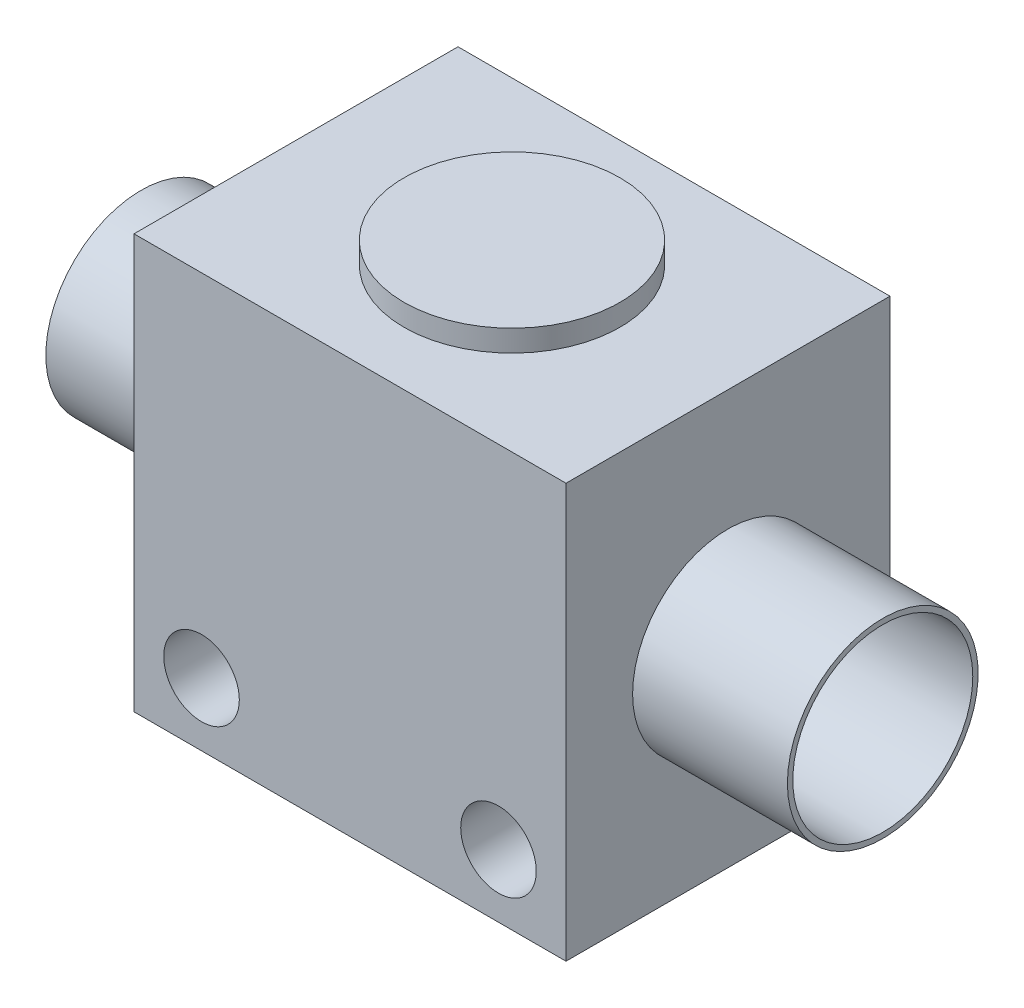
ISO-10303-21;
HEADER;
FILE_DESCRIPTION(('STEP AP214'),'2;1');
FILE_NAME('part.step','',(''),(''),'','','');
FILE_SCHEMA(('AUTOMOTIVE_DESIGN { 1 0 10303 214 1 1 1 1 }'));
ENDSEC;
DATA;
#1=APPLICATION_CONTEXT('core data for automotive mechanical design processes');
#2=APPLICATION_PROTOCOL_DEFINITION('international standard','automotive_design',2000,#1);
#3=PRODUCT_CONTEXT('',#1,'mechanical');
#4=PRODUCT('Part','Part','',(#3));
#5=PRODUCT_RELATED_PRODUCT_CATEGORY('part','',(#4));
#6=PRODUCT_DEFINITION_FORMATION('','',#4);
#7=PRODUCT_DEFINITION_CONTEXT('part definition',#1,'design');
#8=PRODUCT_DEFINITION('design','',#6,#7);
#9=PRODUCT_DEFINITION_SHAPE('','',#8);
#10=(LENGTH_UNIT() NAMED_UNIT(*) SI_UNIT(.MILLI.,.METRE.));
#11=(NAMED_UNIT(*) PLANE_ANGLE_UNIT() SI_UNIT($,.RADIAN.));
#12=(NAMED_UNIT(*) SI_UNIT($,.STERADIAN.) SOLID_ANGLE_UNIT());
#13=UNCERTAINTY_MEASURE_WITH_UNIT(LENGTH_MEASURE(1.E-05),#10,'distance_accuracy_value','');
#14=(GEOMETRIC_REPRESENTATION_CONTEXT(3) GLOBAL_UNCERTAINTY_ASSIGNED_CONTEXT((#13)) GLOBAL_UNIT_ASSIGNED_CONTEXT((#10,
#11,#12)) REPRESENTATION_CONTEXT('',''));
#15=CARTESIAN_POINT('',(0.,0.,0.));
#16=DIRECTION('',(0.,0.,1.));
#17=DIRECTION('',(1.,0.,0.));
#18=AXIS2_PLACEMENT_3D('',#15,#16,#17);
#19=CARTESIAN_POINT('',(-12.,12.,9.));
#20=DIRECTION('',(0.,-1.,0.));
#21=DIRECTION('',(0.,0.,-1.));
#22=AXIS2_PLACEMENT_3D('',#19,#20,#21);
#23=PLANE('',#22);
#24=DIRECTION('',(-1.,0.,0.));
#25=VECTOR('',#24,1.);
#26=CARTESIAN_POINT('',(-12.,12.,-9.));
#27=LINE('',#26,#25);
#28=CARTESIAN_POINT('',(12.,12.,-9.));
#29=VERTEX_POINT('',#28);
#30=CARTESIAN_POINT('',(-12.,12.,-9.));
#31=VERTEX_POINT('',#30);
#32=EDGE_CURVE('E101',#29,#31,#27,.T.);
#33=ORIENTED_EDGE('',*,*,#32,.T.);
#34=DIRECTION('',(0.,0.,-1.));
#35=VECTOR('',#34,1.);
#36=CARTESIAN_POINT('',(-12.,12.,9.));
#37=LINE('',#36,#35);
#38=CARTESIAN_POINT('',(-12.,12.,9.));
#39=VERTEX_POINT('',#38);
#40=EDGE_CURVE('E92',#39,#31,#37,.T.);
#41=ORIENTED_EDGE('',*,*,#40,.F.);
#42=DIRECTION('',(-1.,0.,0.));
#43=VECTOR('',#42,1.);
#44=CARTESIAN_POINT('',(-12.,12.,9.));
#45=LINE('',#44,#43);
#46=CARTESIAN_POINT('',(12.,12.,9.));
#47=VERTEX_POINT('',#46);
#48=EDGE_CURVE('E44',#47,#39,#45,.T.);
#49=ORIENTED_EDGE('',*,*,#48,.F.);
#50=DIRECTION('',(0.,0.,-1.));
#51=VECTOR('',#50,1.);
#52=CARTESIAN_POINT('',(12.,12.,9.));
#53=LINE('',#52,#51);
#54=EDGE_CURVE('E109',#47,#29,#53,.T.);
#55=ORIENTED_EDGE('',*,*,#54,.T.);
#56=EDGE_LOOP('',(#33,#41,#49,#55));
#57=FACE_BOUND('',#56,.T.);
#58=CARTESIAN_POINT('',(0.,12.,0.));
#59=DIRECTION('',(0.,-1.,0.));
#60=DIRECTION('',(0.,0.,-1.));
#61=AXIS2_PLACEMENT_3D('',#58,#59,#60);
#62=CIRCLE('',#61,6.);
#63=CARTESIAN_POINT('',(0.,12.,-6.));
#64=VERTEX_POINT('',#63);
#65=EDGE_CURVE('E11',#64,#64,#62,.F.);
#66=ORIENTED_EDGE('',*,*,#65,.F.);
#67=EDGE_LOOP('',(#66));
#68=FACE_BOUND('',#67,.T.);
#69=ADVANCED_FACE('F29',(#57,#68),#23,.F.);
#70=CARTESIAN_POINT('',(-12.,-11.,9.));
#71=DIRECTION('',(1.,0.,0.));
#72=DIRECTION('',(0.,0.,-1.));
#73=AXIS2_PLACEMENT_3D('',#70,#71,#72);
#74=PLANE('',#73);
#75=DIRECTION('',(0.,-1.,0.));
#76=VECTOR('',#75,1.);
#77=CARTESIAN_POINT('',(-12.,-11.,-8.99999999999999));
#78=LINE('',#77,#76);
#79=CARTESIAN_POINT('',(-12.,-11.,-8.99999999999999));
#80=VERTEX_POINT('',#79);
#81=EDGE_CURVE('E75',#31,#80,#78,.T.);
#82=ORIENTED_EDGE('',*,*,#81,.T.);
#83=DIRECTION('',(0.,0.,-1.));
#84=VECTOR('',#83,1.);
#85=CARTESIAN_POINT('',(-12.,-11.,9.));
#86=LINE('',#85,#84);
#87=CARTESIAN_POINT('',(-12.,-11.,9.));
#88=VERTEX_POINT('',#87);
#89=EDGE_CURVE('E82',#88,#80,#86,.T.);
#90=ORIENTED_EDGE('',*,*,#89,.F.);
#91=DIRECTION('',(0.,-1.,0.));
#92=VECTOR('',#91,1.);
#93=CARTESIAN_POINT('',(-12.,-11.,9.));
#94=LINE('',#93,#92);
#95=EDGE_CURVE('E103',#39,#88,#94,.T.);
#96=ORIENTED_EDGE('',*,*,#95,.F.);
#97=ORIENTED_EDGE('',*,*,#40,.T.);
#98=EDGE_LOOP('',(#82,#90,#96,#97));
#99=FACE_BOUND('',#98,.T.);
#100=CARTESIAN_POINT('',(-12.,0.,0.));
#101=DIRECTION('',(1.,0.,0.));
#102=DIRECTION('',(0.,0.,-1.));
#103=AXIS2_PLACEMENT_3D('',#100,#101,#102);
#104=CIRCLE('',#103,5.3);
#105=CARTESIAN_POINT('',(-12.,0.,-5.3));
#106=VERTEX_POINT('',#105);
#107=EDGE_CURVE('E37',#106,#106,#104,.F.);
#108=ORIENTED_EDGE('',*,*,#107,.F.);
#109=EDGE_LOOP('',(#108));
#110=FACE_BOUND('',#109,.T.);
#111=ADVANCED_FACE('F31',(#99,#110),#74,.F.);
#112=CARTESIAN_POINT('',(12.,-11.,9.));
#113=DIRECTION('',(-1.,0.,0.));
#114=DIRECTION('',(0.,0.,1.));
#115=AXIS2_PLACEMENT_3D('',#112,#113,#114);
#116=PLANE('',#115);
#117=DIRECTION('',(0.,1.,0.));
#118=VECTOR('',#117,1.);
#119=CARTESIAN_POINT('',(12.,-11.,-8.99999999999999));
#120=LINE('',#119,#118);
#121=CARTESIAN_POINT('',(12.,-11.,-8.99999999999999));
#122=VERTEX_POINT('',#121);
#123=EDGE_CURVE('E76',#122,#29,#120,.T.);
#124=ORIENTED_EDGE('',*,*,#123,.T.);
#125=ORIENTED_EDGE('',*,*,#54,.F.);
#126=DIRECTION('',(0.,1.,0.));
#127=VECTOR('',#126,1.);
#128=CARTESIAN_POINT('',(12.,-11.,9.));
#129=LINE('',#128,#127);
#130=CARTESIAN_POINT('',(12.,-11.,9.));
#131=VERTEX_POINT('',#130);
#132=EDGE_CURVE('E49',#131,#47,#129,.T.);
#133=ORIENTED_EDGE('',*,*,#132,.F.);
#134=DIRECTION('',(0.,0.,-1.));
#135=VECTOR('',#134,1.);
#136=CARTESIAN_POINT('',(12.,-11.,9.));
#137=LINE('',#136,#135);
#138=EDGE_CURVE('E88',#131,#122,#137,.T.);
#139=ORIENTED_EDGE('',*,*,#138,.T.);
#140=EDGE_LOOP('',(#124,#125,#133,#139));
#141=FACE_BOUND('',#140,.T.);
#142=CARTESIAN_POINT('',(12.,0.,0.));
#143=DIRECTION('',(-1.,0.,0.));
#144=DIRECTION('',(0.,0.,1.));
#145=AXIS2_PLACEMENT_3D('',#142,#143,#144);
#146=CIRCLE('',#145,5.3);
#147=CARTESIAN_POINT('',(12.,0.,5.3));
#148=VERTEX_POINT('',#147);
#149=EDGE_CURVE('E87',#148,#148,#146,.F.);
#150=ORIENTED_EDGE('',*,*,#149,.F.);
#151=EDGE_LOOP('',(#150));
#152=FACE_BOUND('',#151,.T.);
#153=ADVANCED_FACE('F119',(#141,#152),#116,.F.);
#154=CARTESIAN_POINT('',(-12.,-11.,9.));
#155=DIRECTION('',(0.,1.,0.));
#156=DIRECTION('',(0.,0.,1.));
#157=AXIS2_PLACEMENT_3D('',#154,#155,#156);
#158=PLANE('',#157);
#159=DIRECTION('',(1.,0.,0.));
#160=VECTOR('',#159,1.);
#161=CARTESIAN_POINT('',(-12.,-11.,-8.99999999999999));
#162=LINE('',#161,#160);
#163=EDGE_CURVE('E70',#80,#122,#162,.T.);
#164=ORIENTED_EDGE('',*,*,#163,.T.);
#165=ORIENTED_EDGE('',*,*,#138,.F.);
#166=DIRECTION('',(1.,0.,0.));
#167=VECTOR('',#166,1.);
#168=CARTESIAN_POINT('',(-12.,-11.,9.));
#169=LINE('',#168,#167);
#170=EDGE_CURVE('E84',#88,#131,#169,.T.);
#171=ORIENTED_EDGE('',*,*,#170,.F.);
#172=ORIENTED_EDGE('',*,*,#89,.T.);
#173=EDGE_LOOP('',(#164,#165,#171,#172));
#174=FACE_BOUND('',#173,.T.);
#175=ADVANCED_FACE('F83',(#174),#158,.F.);
#176=CARTESIAN_POINT('',(-12.,12.,9.));
#177=DIRECTION('',(0.,0.,-1.));
#178=DIRECTION('',(-1.,0.,0.));
#179=AXIS2_PLACEMENT_3D('',#176,#177,#178);
#180=PLANE('',#179);
#181=CARTESIAN_POINT('',(8.25000000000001,-7.5,9.));
#182=DIRECTION('',(0.,0.,1.));
#183=DIRECTION('',(-1.,0.,0.));
#184=AXIS2_PLACEMENT_3D('',#181,#182,#183);
#185=CIRCLE('',#184,2.1);
#186=CARTESIAN_POINT('',(6.15000000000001,-7.5,9.));
#187=VERTEX_POINT('',#186);
#188=EDGE_CURVE('E147',#187,#187,#185,.T.);
#189=ORIENTED_EDGE('',*,*,#188,.F.);
#190=EDGE_LOOP('',(#189));
#191=FACE_BOUND('',#190,.T.);
#192=CARTESIAN_POINT('',(-8.25000000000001,-7.5,9.));
#193=DIRECTION('',(0.,0.,1.));
#194=DIRECTION('',(1.,0.,0.));
#195=AXIS2_PLACEMENT_3D('',#192,#193,#194);
#196=CIRCLE('',#195,2.1);
#197=CARTESIAN_POINT('',(-6.15000000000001,-7.5,9.));
#198=VERTEX_POINT('',#197);
#199=EDGE_CURVE('E150',#198,#198,#196,.T.);
#200=ORIENTED_EDGE('',*,*,#199,.F.);
#201=EDGE_LOOP('',(#200));
#202=FACE_BOUND('',#201,.T.);
#203=ORIENTED_EDGE('',*,*,#95,.T.);
#204=ORIENTED_EDGE('',*,*,#170,.T.);
#205=ORIENTED_EDGE('',*,*,#132,.T.);
#206=ORIENTED_EDGE('',*,*,#48,.T.);
#207=EDGE_LOOP('',(#203,#204,#205,#206));
#208=FACE_BOUND('',#207,.T.);
#209=ADVANCED_FACE('F132',(#191,#202,#208),#180,.F.);
#210=CARTESIAN_POINT('',(-12.,12.,-9.));
#211=DIRECTION('',(0.,0.,-1.));
#212=DIRECTION('',(-1.,0.,0.));
#213=AXIS2_PLACEMENT_3D('',#210,#211,#212);
#214=PLANE('',#213);
#215=CARTESIAN_POINT('',(8.25000000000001,-7.49999999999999,-9.));
#216=DIRECTION('',(0.,0.,1.));
#217=DIRECTION('',(-1.,0.,0.));
#218=AXIS2_PLACEMENT_3D('',#215,#216,#217);
#219=CIRCLE('',#218,2.1);
#220=CARTESIAN_POINT('',(6.15000000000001,-7.49999999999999,-9.));
#221=VERTEX_POINT('',#220);
#222=EDGE_CURVE('E208',#221,#221,#219,.T.);
#223=ORIENTED_EDGE('',*,*,#222,.T.);
#224=EDGE_LOOP('',(#223));
#225=FACE_BOUND('',#224,.T.);
#226=CARTESIAN_POINT('',(-8.25000000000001,-7.5,-9.));
#227=DIRECTION('',(0.,0.,1.));
#228=DIRECTION('',(1.,0.,0.));
#229=AXIS2_PLACEMENT_3D('',#226,#227,#228);
#230=CIRCLE('',#229,2.1);
#231=CARTESIAN_POINT('',(-6.15000000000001,-7.5,-9.));
#232=VERTEX_POINT('',#231);
#233=EDGE_CURVE('E213',#232,#232,#230,.T.);
#234=ORIENTED_EDGE('',*,*,#233,.T.);
#235=EDGE_LOOP('',(#234));
#236=FACE_BOUND('',#235,.T.);
#237=ORIENTED_EDGE('',*,*,#81,.F.);
#238=ORIENTED_EDGE('',*,*,#32,.F.);
#239=ORIENTED_EDGE('',*,*,#123,.F.);
#240=ORIENTED_EDGE('',*,*,#163,.F.);
#241=EDGE_LOOP('',(#237,#238,#239,#240));
#242=FACE_BOUND('',#241,.T.);
#243=ADVANCED_FACE('F72',(#225,#236,#242),#214,.T.);
#244=CARTESIAN_POINT('',(20.6,0.,0.));
#245=DIRECTION('',(-1.,0.,0.));
#246=DIRECTION('',(0.,0.,1.));
#247=AXIS2_PLACEMENT_3D('',#244,#245,#246);
#248=CYLINDRICAL_SURFACE('',#247,5.3);
#249=CARTESIAN_POINT('',(20.6,0.,0.));
#250=DIRECTION('',(1.,0.,0.));
#251=DIRECTION('',(0.,0.,-1.));
#252=AXIS2_PLACEMENT_3D('',#249,#250,#251);
#253=CIRCLE('',#252,5.3);
#254=CARTESIAN_POINT('',(20.6,0.,5.3));
#255=VERTEX_POINT('',#254);
#256=EDGE_CURVE('E93',#255,#255,#253,.T.);
#257=CARTESIAN_POINT('',(20.6,0.,5.3));
#258=CARTESIAN_POINT('',(20.5104166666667,0.,5.3));
#259=CARTESIAN_POINT('',(20.4208333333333,0.,5.3));
#260=CARTESIAN_POINT('',(20.2416666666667,0.,5.3));
#261=CARTESIAN_POINT('',(20.1520833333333,0.,5.3));
#262=CARTESIAN_POINT('',(19.9729166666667,0.,5.3));
#263=CARTESIAN_POINT('',(19.8833333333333,0.,5.3));
#264=CARTESIAN_POINT('',(19.7041666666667,0.,5.3));
#265=CARTESIAN_POINT('',(19.6145833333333,0.,5.3));
#266=CARTESIAN_POINT('',(19.4354166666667,0.,5.3));
#267=CARTESIAN_POINT('',(19.3458333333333,0.,5.3));
#268=CARTESIAN_POINT('',(19.1666666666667,0.,5.3));
#269=CARTESIAN_POINT('',(19.0770833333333,0.,5.3));
#270=CARTESIAN_POINT('',(18.8979166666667,0.,5.3));
#271=CARTESIAN_POINT('',(18.8083333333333,0.,5.3));
#272=CARTESIAN_POINT('',(18.6291666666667,0.,5.3));
#273=CARTESIAN_POINT('',(18.5395833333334,0.,5.3));
#274=CARTESIAN_POINT('',(18.3604166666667,0.,5.3));
#275=CARTESIAN_POINT('',(18.2708333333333,0.,5.3));
#276=CARTESIAN_POINT('',(18.0916666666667,0.,5.3));
#277=CARTESIAN_POINT('',(18.0020833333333,0.,5.3));
#278=CARTESIAN_POINT('',(17.8229166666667,0.,5.3));
#279=CARTESIAN_POINT('',(17.7333333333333,0.,5.3));
#280=CARTESIAN_POINT('',(17.5541666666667,0.,5.3));
#281=CARTESIAN_POINT('',(17.4645833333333,0.,5.3));
#282=CARTESIAN_POINT('',(17.2854166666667,0.,5.3));
#283=CARTESIAN_POINT('',(17.1958333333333,0.,5.3));
#284=CARTESIAN_POINT('',(17.0166666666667,0.,5.3));
#285=CARTESIAN_POINT('',(16.9270833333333,0.,5.3));
#286=CARTESIAN_POINT('',(16.7479166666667,0.,5.3));
#287=CARTESIAN_POINT('',(16.6583333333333,0.,5.3));
#288=CARTESIAN_POINT('',(16.4791666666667,0.,5.3));
#289=CARTESIAN_POINT('',(16.3895833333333,0.,5.3));
#290=CARTESIAN_POINT('',(16.2104166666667,0.,5.3));
#291=CARTESIAN_POINT('',(16.1208333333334,0.,5.3));
#292=CARTESIAN_POINT('',(15.9416666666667,0.,5.3));
#293=CARTESIAN_POINT('',(15.8520833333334,0.,5.3));
#294=CARTESIAN_POINT('',(15.6729166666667,0.,5.3));
#295=CARTESIAN_POINT('',(15.5833333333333,0.,5.3));
#296=CARTESIAN_POINT('',(15.4041666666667,0.,5.3));
#297=CARTESIAN_POINT('',(15.3145833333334,0.,5.3));
#298=CARTESIAN_POINT('',(15.1354166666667,0.,5.3));
#299=CARTESIAN_POINT('',(15.0458333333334,0.,5.3));
#300=CARTESIAN_POINT('',(14.8666666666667,0.,5.3));
#301=CARTESIAN_POINT('',(14.7770833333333,0.,5.3));
#302=CARTESIAN_POINT('',(14.5979166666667,0.,5.3));
#303=CARTESIAN_POINT('',(14.5083333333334,0.,5.3));
#304=CARTESIAN_POINT('',(14.3291666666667,0.,5.3));
#305=CARTESIAN_POINT('',(14.2395833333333,0.,5.3));
#306=CARTESIAN_POINT('',(14.0604166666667,0.,5.3));
#307=CARTESIAN_POINT('',(13.9708333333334,0.,5.3));
#308=CARTESIAN_POINT('',(13.7916666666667,0.,5.3));
#309=CARTESIAN_POINT('',(13.7020833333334,0.,5.3));
#310=CARTESIAN_POINT('',(13.5229166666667,0.,5.3));
#311=CARTESIAN_POINT('',(13.4333333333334,0.,5.3));
#312=CARTESIAN_POINT('',(13.2541666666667,0.,5.3));
#313=CARTESIAN_POINT('',(13.1645833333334,0.,5.3));
#314=CARTESIAN_POINT('',(12.9854166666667,0.,5.3));
#315=CARTESIAN_POINT('',(12.8958333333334,0.,5.3));
#316=CARTESIAN_POINT('',(12.7166666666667,0.,5.3));
#317=CARTESIAN_POINT('',(12.6270833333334,0.,5.3));
#318=CARTESIAN_POINT('',(12.4479166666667,0.,5.3));
#319=CARTESIAN_POINT('',(12.3583333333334,0.,5.3));
#320=CARTESIAN_POINT('',(12.1791666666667,0.,5.3));
#321=CARTESIAN_POINT('',(12.0895833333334,0.,5.3));
#322=CARTESIAN_POINT('',(12.,0.,5.3));
#323=B_SPLINE_CURVE_WITH_KNOTS('',3,(#257,#258,#259,#260,#261,#262,#263,#264,#265,#266,#267,
#268,#269,#270,#271,#272,#273,#274,#275,#276,#277,#278,#279,#280,#281,#282,#283,#284,#285,#286,
#287,#288,#289,#290,#291,#292,#293,#294,#295,#296,#297,#298,#299,#300,#301,#302,#303,#304,#305,
#306,#307,#308,#309,#310,#311,#312,#313,#314,#315,#316,#317,#318,#319,#320,#321,#322),
.UNSPECIFIED.,.F.,.F.,(4,2,2,2,2,2,2,2,2,2,2,2,2,2,2,2,2,2,2,2,2,2,2,2,2,2,2,2,2,2,2,2,4),(0.,
0.268750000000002,0.5375,0.806250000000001,1.075,1.34375,1.6125,1.88125,2.15,2.41875,2.6875,
2.95625,3.225,3.49375,3.7625,4.03125,4.3,4.56875,4.8375,5.10625,5.375,5.64375,5.9125,6.18125,
6.45,6.71875,6.9875,7.25625,7.525,7.79374999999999,8.06249999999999,8.33125,8.59999999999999),.UNSPECIFIED.);
#324=EDGE_CURVE('BSEAM142',#255,#148,#323,.T.);
#325=ORIENTED_EDGE('',*,*,#256,.F.);
#326=ORIENTED_EDGE('',*,*,#149,.T.);
#327=ORIENTED_EDGE('',*,*,#324,.T.);
#328=ORIENTED_EDGE('',*,*,#324,.F.);
#329=EDGE_LOOP('',(#325,#327,#326,#328));
#330=FACE_BOUND('',#329,.T.);
#331=ADVANCED_FACE('F142',(#330),#248,.T.);
#332=CARTESIAN_POINT('',(20.6,0.,0.));
#333=DIRECTION('',(1.,0.,0.));
#334=DIRECTION('',(0.,0.,-1.));
#335=AXIS2_PLACEMENT_3D('',#332,#333,#334);
#336=PLANE('',#335);
#337=CARTESIAN_POINT('',(20.6,0.,0.));
#338=DIRECTION('',(1.,0.,0.));
#339=DIRECTION('',(0.,0.,-1.));
#340=AXIS2_PLACEMENT_3D('',#337,#338,#339);
#341=CIRCLE('',#340,5.);
#342=CARTESIAN_POINT('',(20.6,0.,-5.));
#343=VERTEX_POINT('',#342);
#344=EDGE_CURVE('E228',#343,#343,#341,.T.);
#345=ORIENTED_EDGE('',*,*,#344,.F.);
#346=EDGE_LOOP('',(#345));
#347=FACE_BOUND('',#346,.T.);
#348=ORIENTED_EDGE('',*,*,#256,.T.);
#349=EDGE_LOOP('',(#348));
#350=FACE_BOUND('',#349,.T.);
#351=ADVANCED_FACE('F155',(#347,#350),#336,.T.);
#352=CARTESIAN_POINT('',(10.6,0.,0.));
#353=DIRECTION('',(1.,0.,0.));
#354=DIRECTION('',(0.,0.,-1.));
#355=AXIS2_PLACEMENT_3D('',#352,#353,#354);
#356=CYLINDRICAL_SURFACE('',#355,5.);
#357=CARTESIAN_POINT('',(10.6,0.,0.));
#358=DIRECTION('',(1.,0.,0.));
#359=DIRECTION('',(0.,0.,-1.));
#360=AXIS2_PLACEMENT_3D('',#357,#358,#359);
#361=CIRCLE('',#360,5.);
#362=CARTESIAN_POINT('',(10.6,0.,-5.));
#363=VERTEX_POINT('',#362);
#364=EDGE_CURVE('E96',#363,#363,#361,.T.);
#365=ORIENTED_EDGE('',*,*,#364,.F.);
#366=EDGE_LOOP('',(#365));
#367=FACE_BOUND('',#366,.T.);
#368=ORIENTED_EDGE('',*,*,#344,.T.);
#369=EDGE_LOOP('',(#368));
#370=FACE_BOUND('',#369,.T.);
#371=ADVANCED_FACE('F161',(#367,#370),#356,.F.);
#372=CARTESIAN_POINT('',(10.6,0.,0.));
#373=DIRECTION('',(1.,0.,0.));
#374=DIRECTION('',(0.,0.,-1.));
#375=AXIS2_PLACEMENT_3D('',#372,#373,#374);
#376=PLANE('',#375);
#377=ORIENTED_EDGE('',*,*,#364,.T.);
#378=EDGE_LOOP('',(#377));
#379=FACE_BOUND('',#378,.T.);
#380=ADVANCED_FACE('F168',(#379),#376,.T.);
#381=CARTESIAN_POINT('',(-20.6,0.,0.));
#382=DIRECTION('',(1.,0.,0.));
#383=DIRECTION('',(0.,0.,-1.));
#384=AXIS2_PLACEMENT_3D('',#381,#382,#383);
#385=CYLINDRICAL_SURFACE('',#384,5.3);
#386=CARTESIAN_POINT('',(-20.6,0.,0.));
#387=DIRECTION('',(-1.,0.,0.));
#388=DIRECTION('',(0.,0.,1.));
#389=AXIS2_PLACEMENT_3D('',#386,#387,#388);
#390=CIRCLE('',#389,5.3);
#391=CARTESIAN_POINT('',(-20.6,0.,-5.3));
#392=VERTEX_POINT('',#391);
#393=EDGE_CURVE('E225',#392,#392,#390,.T.);
#394=CARTESIAN_POINT('',(-20.6,0.,-5.3));
#395=CARTESIAN_POINT('',(-20.5104166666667,0.,-5.3));
#396=CARTESIAN_POINT('',(-20.4208333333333,0.,-5.3));
#397=CARTESIAN_POINT('',(-20.2416666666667,0.,-5.3));
#398=CARTESIAN_POINT('',(-20.1520833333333,0.,-5.3));
#399=CARTESIAN_POINT('',(-19.9729166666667,0.,-5.3));
#400=CARTESIAN_POINT('',(-19.8833333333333,0.,-5.3));
#401=CARTESIAN_POINT('',(-19.7041666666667,0.,-5.3));
#402=CARTESIAN_POINT('',(-19.6145833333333,0.,-5.3));
#403=CARTESIAN_POINT('',(-19.4354166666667,0.,-5.3));
#404=CARTESIAN_POINT('',(-19.3458333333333,0.,-5.3));
#405=CARTESIAN_POINT('',(-19.1666666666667,0.,-5.3));
#406=CARTESIAN_POINT('',(-19.0770833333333,0.,-5.3));
#407=CARTESIAN_POINT('',(-18.8979166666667,0.,-5.3));
#408=CARTESIAN_POINT('',(-18.8083333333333,0.,-5.3));
#409=CARTESIAN_POINT('',(-18.6291666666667,0.,-5.3));
#410=CARTESIAN_POINT('',(-18.5395833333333,0.,-5.3));
#411=CARTESIAN_POINT('',(-18.3604166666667,0.,-5.3));
#412=CARTESIAN_POINT('',(-18.2708333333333,0.,-5.3));
#413=CARTESIAN_POINT('',(-18.0916666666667,0.,-5.3));
#414=CARTESIAN_POINT('',(-18.0020833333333,0.,-5.3));
#415=CARTESIAN_POINT('',(-17.8229166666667,0.,-5.3));
#416=CARTESIAN_POINT('',(-17.7333333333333,0.,-5.3));
#417=CARTESIAN_POINT('',(-17.5541666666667,0.,-5.3));
#418=CARTESIAN_POINT('',(-17.4645833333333,0.,-5.3));
#419=CARTESIAN_POINT('',(-17.2854166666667,0.,-5.3));
#420=CARTESIAN_POINT('',(-17.1958333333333,0.,-5.3));
#421=CARTESIAN_POINT('',(-17.0166666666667,0.,-5.3));
#422=CARTESIAN_POINT('',(-16.9270833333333,0.,-5.3));
#423=CARTESIAN_POINT('',(-16.7479166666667,0.,-5.3));
#424=CARTESIAN_POINT('',(-16.6583333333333,0.,-5.3));
#425=CARTESIAN_POINT('',(-16.4791666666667,0.,-5.3));
#426=CARTESIAN_POINT('',(-16.3895833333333,0.,-5.3));
#427=CARTESIAN_POINT('',(-16.2104166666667,0.,-5.3));
#428=CARTESIAN_POINT('',(-16.1208333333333,0.,-5.3));
#429=CARTESIAN_POINT('',(-15.9416666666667,0.,-5.3));
#430=CARTESIAN_POINT('',(-15.8520833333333,0.,-5.3));
#431=CARTESIAN_POINT('',(-15.6729166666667,0.,-5.3));
#432=CARTESIAN_POINT('',(-15.5833333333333,0.,-5.3));
#433=CARTESIAN_POINT('',(-15.4041666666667,0.,-5.3));
#434=CARTESIAN_POINT('',(-15.3145833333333,0.,-5.3));
#435=CARTESIAN_POINT('',(-15.1354166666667,0.,-5.3));
#436=CARTESIAN_POINT('',(-15.0458333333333,0.,-5.3));
#437=CARTESIAN_POINT('',(-14.8666666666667,0.,-5.3));
#438=CARTESIAN_POINT('',(-14.7770833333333,0.,-5.3));
#439=CARTESIAN_POINT('',(-14.5979166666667,0.,-5.3));
#440=CARTESIAN_POINT('',(-14.5083333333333,0.,-5.3));
#441=CARTESIAN_POINT('',(-14.3291666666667,0.,-5.3));
#442=CARTESIAN_POINT('',(-14.2395833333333,0.,-5.3));
#443=CARTESIAN_POINT('',(-14.0604166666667,0.,-5.3));
#444=CARTESIAN_POINT('',(-13.9708333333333,0.,-5.3));
#445=CARTESIAN_POINT('',(-13.7916666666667,0.,-5.3));
#446=CARTESIAN_POINT('',(-13.7020833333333,0.,-5.3));
#447=CARTESIAN_POINT('',(-13.5229166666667,0.,-5.3));
#448=CARTESIAN_POINT('',(-13.4333333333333,0.,-5.3));
#449=CARTESIAN_POINT('',(-13.2541666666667,0.,-5.3));
#450=CARTESIAN_POINT('',(-13.1645833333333,0.,-5.3));
#451=CARTESIAN_POINT('',(-12.9854166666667,0.,-5.3));
#452=CARTESIAN_POINT('',(-12.8958333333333,0.,-5.3));
#453=CARTESIAN_POINT('',(-12.7166666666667,0.,-5.3));
#454=CARTESIAN_POINT('',(-12.6270833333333,0.,-5.3));
#455=CARTESIAN_POINT('',(-12.4479166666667,0.,-5.3));
#456=CARTESIAN_POINT('',(-12.3583333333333,0.,-5.3));
#457=CARTESIAN_POINT('',(-12.1791666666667,0.,-5.3));
#458=CARTESIAN_POINT('',(-12.0895833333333,0.,-5.3));
#459=CARTESIAN_POINT('',(-12.,0.,-5.3));
#460=B_SPLINE_CURVE_WITH_KNOTS('',3,(#394,#395,#396,#397,#398,#399,#400,#401,#402,#403,#404,
#405,#406,#407,#408,#409,#410,#411,#412,#413,#414,#415,#416,#417,#418,#419,#420,#421,#422,#423,
#424,#425,#426,#427,#428,#429,#430,#431,#432,#433,#434,#435,#436,#437,#438,#439,#440,#441,#442,
#443,#444,#445,#446,#447,#448,#449,#450,#451,#452,#453,#454,#455,#456,#457,#458,#459),
.UNSPECIFIED.,.F.,.F.,(4,2,2,2,2,2,2,2,2,2,2,2,2,2,2,2,2,2,2,2,2,2,2,2,2,2,2,2,2,2,2,2,4),(0.,
0.268750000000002,0.5375,0.806250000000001,1.075,1.34375,1.6125,1.88125,2.15,2.41875,2.6875,
2.95625,3.225,3.49375,3.7625,4.03125,4.3,4.56875,4.8375,5.10625,5.375,5.64375,5.9125,6.18125,
6.45,6.71875,6.9875,7.25625,7.525,7.79374999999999,8.06249999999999,8.33125,8.59999999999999),.UNSPECIFIED.);
#461=EDGE_CURVE('BSEAM117',#392,#106,#460,.T.);
#462=ORIENTED_EDGE('',*,*,#393,.F.);
#463=ORIENTED_EDGE('',*,*,#107,.T.);
#464=ORIENTED_EDGE('',*,*,#461,.T.);
#465=ORIENTED_EDGE('',*,*,#461,.F.);
#466=EDGE_LOOP('',(#462,#464,#463,#465));
#467=FACE_BOUND('',#466,.T.);
#468=ADVANCED_FACE('F117',(#467),#385,.T.);
#469=CARTESIAN_POINT('',(-20.6,0.,0.));
#470=DIRECTION('',(-1.,0.,0.));
#471=DIRECTION('',(0.,0.,1.));
#472=AXIS2_PLACEMENT_3D('',#469,#470,#471);
#473=PLANE('',#472);
#474=CARTESIAN_POINT('',(-20.6,0.,0.));
#475=DIRECTION('',(-1.,0.,0.));
#476=DIRECTION('',(0.,0.,1.));
#477=AXIS2_PLACEMENT_3D('',#474,#475,#476);
#478=CIRCLE('',#477,5.);
#479=CARTESIAN_POINT('',(-20.6,0.,5.));
#480=VERTEX_POINT('',#479);
#481=EDGE_CURVE('E219',#480,#480,#478,.T.);
#482=ORIENTED_EDGE('',*,*,#481,.F.);
#483=EDGE_LOOP('',(#482));
#484=FACE_BOUND('',#483,.T.);
#485=ORIENTED_EDGE('',*,*,#393,.T.);
#486=EDGE_LOOP('',(#485));
#487=FACE_BOUND('',#486,.T.);
#488=ADVANCED_FACE('F175',(#484,#487),#473,.T.);
#489=CARTESIAN_POINT('',(-10.6,0.,0.));
#490=DIRECTION('',(-1.,0.,0.));
#491=DIRECTION('',(0.,0.,1.));
#492=AXIS2_PLACEMENT_3D('',#489,#490,#491);
#493=CYLINDRICAL_SURFACE('',#492,5.);
#494=CARTESIAN_POINT('',(-10.6,0.,0.));
#495=DIRECTION('',(-1.,0.,0.));
#496=DIRECTION('',(0.,0.,1.));
#497=AXIS2_PLACEMENT_3D('',#494,#495,#496);
#498=CIRCLE('',#497,5.);
#499=CARTESIAN_POINT('',(-10.6,0.,5.));
#500=VERTEX_POINT('',#499);
#501=EDGE_CURVE('E222',#500,#500,#498,.T.);
#502=ORIENTED_EDGE('',*,*,#501,.F.);
#503=EDGE_LOOP('',(#502));
#504=FACE_BOUND('',#503,.T.);
#505=ORIENTED_EDGE('',*,*,#481,.T.);
#506=EDGE_LOOP('',(#505));
#507=FACE_BOUND('',#506,.T.);
#508=ADVANCED_FACE('F179',(#504,#507),#493,.F.);
#509=CARTESIAN_POINT('',(-10.6,0.,0.));
#510=DIRECTION('',(-1.,0.,0.));
#511=DIRECTION('',(0.,0.,1.));
#512=AXIS2_PLACEMENT_3D('',#509,#510,#511);
#513=PLANE('',#512);
#514=ORIENTED_EDGE('',*,*,#501,.T.);
#515=EDGE_LOOP('',(#514));
#516=FACE_BOUND('',#515,.T.);
#517=ADVANCED_FACE('F183',(#516),#513,.T.);
#518=CARTESIAN_POINT('',(0.,13.2,0.));
#519=DIRECTION('',(0.,-1.,0.));
#520=DIRECTION('',(0.,0.,-1.));
#521=AXIS2_PLACEMENT_3D('',#518,#519,#520);
#522=CYLINDRICAL_SURFACE('',#521,6.);
#523=CARTESIAN_POINT('',(0.,13.2,0.));
#524=DIRECTION('',(0.,1.,0.));
#525=DIRECTION('',(0.,0.,1.));
#526=AXIS2_PLACEMENT_3D('',#523,#524,#525);
#527=CIRCLE('',#526,6.);
#528=CARTESIAN_POINT('',(0.,13.2,6.));
#529=VERTEX_POINT('',#528);
#530=EDGE_CURVE('E216',#529,#529,#527,.T.);
#531=ORIENTED_EDGE('',*,*,#530,.F.);
#532=EDGE_LOOP('',(#531));
#533=FACE_BOUND('',#532,.T.);
#534=ORIENTED_EDGE('',*,*,#65,.T.);
#535=EDGE_LOOP('',(#534));
#536=FACE_BOUND('',#535,.T.);
#537=ADVANCED_FACE('F187',(#533,#536),#522,.T.);
#538=CARTESIAN_POINT('',(0.,13.2,0.));
#539=DIRECTION('',(0.,1.,0.));
#540=DIRECTION('',(0.,0.,1.));
#541=AXIS2_PLACEMENT_3D('',#538,#539,#540);
#542=PLANE('',#541);
#543=ORIENTED_EDGE('',*,*,#530,.T.);
#544=EDGE_LOOP('',(#543));
#545=FACE_BOUND('',#544,.T.);
#546=ADVANCED_FACE('F191',(#545),#542,.T.);
#547=CARTESIAN_POINT('',(-8.25000000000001,-7.5,-9.));
#548=DIRECTION('',(0.,0.,1.));
#549=DIRECTION('',(1.,0.,0.));
#550=AXIS2_PLACEMENT_3D('',#547,#548,#549);
#551=CYLINDRICAL_SURFACE('',#550,2.1);
#552=ORIENTED_EDGE('',*,*,#233,.F.);
#553=EDGE_LOOP('',(#552));
#554=FACE_BOUND('',#553,.T.);
#555=ORIENTED_EDGE('',*,*,#199,.T.);
#556=EDGE_LOOP('',(#555));
#557=FACE_BOUND('',#556,.T.);
#558=ADVANCED_FACE('F195',(#554,#557),#551,.F.);
#559=CARTESIAN_POINT('',(8.25000000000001,-7.49999999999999,-9.));
#560=DIRECTION('',(0.,0.,1.));
#561=DIRECTION('',(1.,0.,0.));
#562=AXIS2_PLACEMENT_3D('',#559,#560,#561);
#563=CYLINDRICAL_SURFACE('',#562,2.1);
#564=ORIENTED_EDGE('',*,*,#222,.F.);
#565=EDGE_LOOP('',(#564));
#566=FACE_BOUND('',#565,.T.);
#567=ORIENTED_EDGE('',*,*,#188,.T.);
#568=EDGE_LOOP('',(#567));
#569=FACE_BOUND('',#568,.T.);
#570=ADVANCED_FACE('F199',(#566,#569),#563,.F.);
#571=CLOSED_SHELL('',(#69,#111,#153,#175,#209,#243,#331,#351,#371,#380,#468,#488,#508,#517,#537,
#546,#558,#570));
#572=MANIFOLD_SOLID_BREP('B2',#571);
#573=ADVANCED_BREP_SHAPE_REPRESENTATION('',(#18,#572),#14);
#574=SHAPE_DEFINITION_REPRESENTATION(#9,#573);
ENDSEC;
END-ISO-10303-21;
